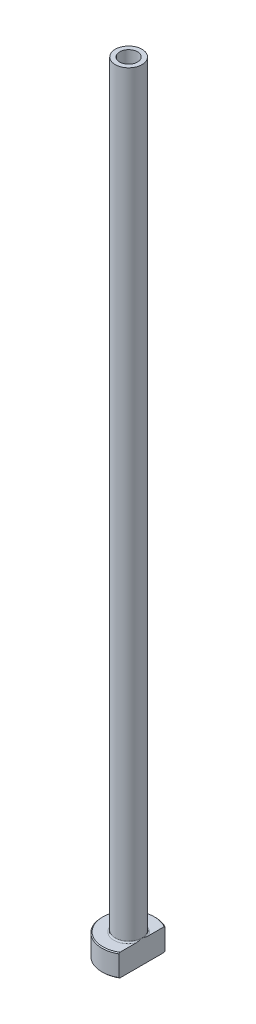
ISO-10303-21;
HEADER;
FILE_DESCRIPTION(('STEP AP214'),'2;1');
FILE_NAME('part.step','',(''),(''),'','','');
FILE_SCHEMA(('AUTOMOTIVE_DESIGN { 1 0 10303 214 1 1 1 1 }'));
ENDSEC;
DATA;
#1=APPLICATION_CONTEXT('core data for automotive mechanical design processes');
#2=APPLICATION_PROTOCOL_DEFINITION('international standard','automotive_design',2000,#1);
#3=PRODUCT_CONTEXT('',#1,'mechanical');
#4=PRODUCT('Part','Part','',(#3));
#5=PRODUCT_RELATED_PRODUCT_CATEGORY('part','',(#4));
#6=PRODUCT_DEFINITION_FORMATION('','',#4);
#7=PRODUCT_DEFINITION_CONTEXT('part definition',#1,'design');
#8=PRODUCT_DEFINITION('design','',#6,#7);
#9=PRODUCT_DEFINITION_SHAPE('','',#8);
#10=(LENGTH_UNIT() NAMED_UNIT(*) SI_UNIT(.MILLI.,.METRE.));
#11=(NAMED_UNIT(*) PLANE_ANGLE_UNIT() SI_UNIT($,.RADIAN.));
#12=(NAMED_UNIT(*) SI_UNIT($,.STERADIAN.) SOLID_ANGLE_UNIT());
#13=UNCERTAINTY_MEASURE_WITH_UNIT(LENGTH_MEASURE(1.E-05),#10,'distance_accuracy_value','');
#14=(GEOMETRIC_REPRESENTATION_CONTEXT(3) GLOBAL_UNCERTAINTY_ASSIGNED_CONTEXT((#13)) GLOBAL_UNIT_ASSIGNED_CONTEXT((#10,
#11,#12)) REPRESENTATION_CONTEXT('',''));
#15=CARTESIAN_POINT('',(0.,0.,0.));
#16=DIRECTION('',(0.,0.,1.));
#17=DIRECTION('',(1.,0.,0.));
#18=AXIS2_PLACEMENT_3D('',#15,#16,#17);
#19=CARTESIAN_POINT('',(0.,92.1876809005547,0.));
#20=DIRECTION('',(0.,1.,0.));
#21=DIRECTION('',(0.,0.,1.));
#22=AXIS2_PLACEMENT_3D('',#19,#20,#21);
#23=CYLINDRICAL_SURFACE('',#22,2.);
#24=CARTESIAN_POINT('',(0.,175.,0.));
#25=DIRECTION('',(0.,1.,0.));
#26=DIRECTION('',(0.,0.,1.));
#27=AXIS2_PLACEMENT_3D('',#24,#25,#26);
#28=CIRCLE('',#27,2.);
#29=CARTESIAN_POINT('',(0.,175.,2.));
#30=VERTEX_POINT('',#29);
#31=EDGE_CURVE('E167',#30,#30,#28,.T.);
#32=ORIENTED_EDGE('',*,*,#31,.T.);
#33=EDGE_LOOP('',(#32));
#34=FACE_BOUND('',#33,.T.);
#35=CARTESIAN_POINT('',(0.,130.,0.));
#36=DIRECTION('',(0.,1.,0.));
#37=DIRECTION('',(0.,0.,1.));
#38=AXIS2_PLACEMENT_3D('',#35,#36,#37);
#39=CIRCLE('',#38,2.);
#40=CARTESIAN_POINT('',(0.,130.,2.));
#41=VERTEX_POINT('',#40);
#42=EDGE_CURVE('E170',#41,#41,#39,.T.);
#43=ORIENTED_EDGE('',*,*,#42,.F.);
#44=EDGE_LOOP('',(#43));
#45=FACE_BOUND('',#44,.T.);
#46=ADVANCED_FACE('F32',(#34,#45),#23,.F.);
#47=CARTESIAN_POINT('',(-2.,175.,0.));
#48=DIRECTION('',(0.,1.,0.));
#49=DIRECTION('',(0.,0.,1.));
#50=AXIS2_PLACEMENT_3D('',#47,#48,#49);
#51=PLANE('',#50);
#52=CARTESIAN_POINT('',(0.,175.,0.));
#53=DIRECTION('',(0.,1.,0.));
#54=DIRECTION('',(0.,0.,1.));
#55=AXIS2_PLACEMENT_3D('',#52,#53,#54);
#56=CIRCLE('',#55,3.00000000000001);
#57=CARTESIAN_POINT('',(0.,175.,3.00000000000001));
#58=VERTEX_POINT('',#57);
#59=EDGE_CURVE('E174',#58,#58,#56,.T.);
#60=ORIENTED_EDGE('',*,*,#59,.T.);
#61=EDGE_LOOP('',(#60));
#62=FACE_BOUND('',#61,.T.);
#63=ORIENTED_EDGE('',*,*,#31,.F.);
#64=EDGE_LOOP('',(#63));
#65=FACE_BOUND('',#64,.T.);
#66=ADVANCED_FACE('F157',(#62,#65),#51,.T.);
#67=CARTESIAN_POINT('',(0.,92.1876809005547,0.));
#68=DIRECTION('',(0.,1.,0.));
#69=DIRECTION('',(0.,0.,1.));
#70=AXIS2_PLACEMENT_3D('',#67,#68,#69);
#71=CYLINDRICAL_SURFACE('',#70,3.);
#72=CARTESIAN_POINT('',(0.,5.3,0.));
#73=DIRECTION('',(0.,1.,0.));
#74=DIRECTION('',(0.,0.,1.));
#75=AXIS2_PLACEMENT_3D('',#72,#73,#74);
#76=CIRCLE('',#75,3.);
#77=CARTESIAN_POINT('',(3.,5.3,0.));
#78=VERTEX_POINT('',#77);
#79=EDGE_CURVE('E180',#78,#78,#76,.T.);
#80=ORIENTED_EDGE('',*,*,#79,.T.);
#81=EDGE_LOOP('',(#80));
#82=FACE_BOUND('',#81,.T.);
#83=ORIENTED_EDGE('',*,*,#59,.F.);
#84=EDGE_LOOP('',(#83));
#85=FACE_BOUND('',#84,.T.);
#86=ADVANCED_FACE('F162',(#82,#85),#71,.T.);
#87=CARTESIAN_POINT('',(-2.99999999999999,5.,0.));
#88=DIRECTION('',(0.,1.,0.));
#89=DIRECTION('',(0.,0.,1.));
#90=AXIS2_PLACEMENT_3D('',#87,#88,#89);
#91=PLANE('',#90);
#92=DIRECTION('',(0.,0.,1.));
#93=VECTOR('',#92,1.);
#94=CARTESIAN_POINT('',(2.99999999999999,5.,0.));
#95=LINE('',#94,#93);
#96=CARTESIAN_POINT('',(3.,5.,-4.96386945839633));
#97=VERTEX_POINT('',#96);
#98=CARTESIAN_POINT('',(2.99999999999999,5.,-1.37477270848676));
#99=VERTEX_POINT('',#98);
#100=EDGE_CURVE('E54',#97,#99,#95,.T.);
#101=ORIENTED_EDGE('',*,*,#100,.F.);
#102=CARTESIAN_POINT('',(0.,5.,0.));
#103=DIRECTION('',(0.,1.,0.));
#104=DIRECTION('',(0.,0.,1.));
#105=AXIS2_PLACEMENT_3D('',#102,#103,#104);
#106=CIRCLE('',#105,5.79999999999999);
#107=CARTESIAN_POINT('',(2.99999999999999,5.,4.96386945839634));
#108=VERTEX_POINT('',#107);
#109=EDGE_CURVE('E186',#97,#108,#106,.T.);
#110=ORIENTED_EDGE('',*,*,#109,.T.);
#111=CARTESIAN_POINT('',(2.99999999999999,5.,1.37477270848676));
#112=VERTEX_POINT('',#111);
#113=EDGE_CURVE('E134',#112,#108,#95,.T.);
#114=ORIENTED_EDGE('',*,*,#113,.F.);
#115=CARTESIAN_POINT('',(0.,5.,0.));
#116=DIRECTION('',(0.,1.,0.));
#117=DIRECTION('',(0.,0.,1.));
#118=AXIS2_PLACEMENT_3D('',#115,#116,#117);
#119=CIRCLE('',#118,3.3);
#120=EDGE_CURVE('E183',#112,#99,#119,.F.);
#121=ORIENTED_EDGE('',*,*,#120,.T.);
#122=EDGE_LOOP('',(#101,#110,#114,#121));
#123=FACE_BOUND('',#122,.T.);
#124=ADVANCED_FACE('F197',(#123),#91,.T.);
#125=CARTESIAN_POINT('',(0.,92.1876809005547,0.));
#126=DIRECTION('',(0.,1.,0.));
#127=DIRECTION('',(0.,0.,1.));
#128=AXIS2_PLACEMENT_3D('',#125,#126,#127);
#129=CYLINDRICAL_SURFACE('',#128,5.99999999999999);
#130=DIRECTION('',(0.,-1.,0.));
#131=VECTOR('',#130,1.);
#132=CARTESIAN_POINT('',(2.99999999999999,175.,5.19615242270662));
#133=LINE('',#132,#131);
#134=CARTESIAN_POINT('',(2.99999999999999,4.8,5.19615242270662));
#135=VERTEX_POINT('',#134);
#136=CARTESIAN_POINT('',(2.99999999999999,0.200000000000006,5.19615242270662));
#137=VERTEX_POINT('',#136);
#138=EDGE_CURVE('E82',#135,#137,#133,.T.);
#139=ORIENTED_EDGE('',*,*,#138,.F.);
#140=CARTESIAN_POINT('',(0.,4.8,0.));
#141=DIRECTION('',(0.,1.,0.));
#142=DIRECTION('',(0.,0.,1.));
#143=AXIS2_PLACEMENT_3D('',#140,#141,#142);
#144=CIRCLE('',#143,5.99999999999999);
#145=CARTESIAN_POINT('',(3.,4.8,-5.19615242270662));
#146=VERTEX_POINT('',#145);
#147=EDGE_CURVE('E95',#135,#146,#144,.F.);
#148=ORIENTED_EDGE('',*,*,#147,.T.);
#149=DIRECTION('',(0.,-1.,0.));
#150=VECTOR('',#149,1.);
#151=CARTESIAN_POINT('',(3.,175.,-5.19615242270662));
#152=LINE('',#151,#150);
#153=CARTESIAN_POINT('',(3.,0.200000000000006,-5.19615242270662));
#154=VERTEX_POINT('',#153);
#155=EDGE_CURVE('E192',#146,#154,#152,.T.);
#156=ORIENTED_EDGE('',*,*,#155,.T.);
#157=CARTESIAN_POINT('',(0.,0.200000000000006,0.));
#158=DIRECTION('',(0.,-1.,0.));
#159=DIRECTION('',(0.,0.,-1.));
#160=AXIS2_PLACEMENT_3D('',#157,#158,#159);
#161=CIRCLE('',#160,5.99999999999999);
#162=EDGE_CURVE('E98',#154,#137,#161,.F.);
#163=ORIENTED_EDGE('',*,*,#162,.T.);
#164=EDGE_LOOP('',(#139,#148,#156,#163));
#165=FACE_BOUND('',#164,.T.);
#166=ADVANCED_FACE('F190',(#165),#129,.T.);
#167=CARTESIAN_POINT('',(-5.99999999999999,0.,0.));
#168=DIRECTION('',(0.,-1.,0.));
#169=DIRECTION('',(0.,0.,-1.));
#170=AXIS2_PLACEMENT_3D('',#167,#168,#169);
#171=PLANE('',#170);
#172=CARTESIAN_POINT('',(0.,0.,0.));
#173=DIRECTION('',(0.,-1.,0.));
#174=DIRECTION('',(0.,0.,-1.));
#175=AXIS2_PLACEMENT_3D('',#172,#173,#174);
#176=CIRCLE('',#175,2.74999999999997);
#177=CARTESIAN_POINT('',(0.,0.,-2.74999999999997));
#178=VERTEX_POINT('',#177);
#179=EDGE_CURVE('E40',#178,#178,#176,.F.);
#180=ORIENTED_EDGE('',*,*,#179,.T.);
#181=EDGE_LOOP('',(#180));
#182=FACE_BOUND('',#181,.T.);
#183=DIRECTION('',(0.,0.,-1.));
#184=VECTOR('',#183,1.);
#185=CARTESIAN_POINT('',(2.99999999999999,0.,5.19615242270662));
#186=LINE('',#185,#184);
#187=CARTESIAN_POINT('',(2.99999999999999,0.,4.96386945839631));
#188=VERTEX_POINT('',#187);
#189=CARTESIAN_POINT('',(3.,0.,-4.96386945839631));
#190=VERTEX_POINT('',#189);
#191=EDGE_CURVE('E47',#188,#190,#186,.T.);
#192=ORIENTED_EDGE('',*,*,#191,.F.);
#193=CARTESIAN_POINT('',(0.,0.,0.));
#194=DIRECTION('',(0.,-1.,0.));
#195=DIRECTION('',(0.,0.,-1.));
#196=AXIS2_PLACEMENT_3D('',#193,#194,#195);
#197=CIRCLE('',#196,5.79999999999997);
#198=EDGE_CURVE('E92',#188,#190,#197,.T.);
#199=ORIENTED_EDGE('',*,*,#198,.T.);
#200=EDGE_LOOP('',(#192,#199));
#201=FACE_BOUND('',#200,.T.);
#202=ADVANCED_FACE('F91',(#182,#201),#171,.T.);
#203=CARTESIAN_POINT('',(0.,92.1876809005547,0.));
#204=DIRECTION('',(0.,1.,0.));
#205=DIRECTION('',(0.,0.,1.));
#206=AXIS2_PLACEMENT_3D('',#203,#204,#205);
#207=CYLINDRICAL_SURFACE('',#206,2.25);
#208=CARTESIAN_POINT('',(0.,0.499999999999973,0.));
#209=DIRECTION('',(0.,-1.,0.));
#210=DIRECTION('',(0.,0.,-1.));
#211=AXIS2_PLACEMENT_3D('',#208,#209,#210);
#212=CIRCLE('',#211,2.25);
#213=CARTESIAN_POINT('',(0.,0.499999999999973,-2.25));
#214=VERTEX_POINT('',#213);
#215=EDGE_CURVE('E11',#214,#214,#212,.T.);
#216=ORIENTED_EDGE('',*,*,#215,.T.);
#217=EDGE_LOOP('',(#216));
#218=FACE_BOUND('',#217,.T.);
#219=CARTESIAN_POINT('',(0.,118.,0.));
#220=DIRECTION('',(0.,1.,0.));
#221=DIRECTION('',(0.,0.,1.));
#222=AXIS2_PLACEMENT_3D('',#219,#220,#221);
#223=CIRCLE('',#222,2.25);
#224=CARTESIAN_POINT('',(0.,118.,2.25));
#225=VERTEX_POINT('',#224);
#226=EDGE_CURVE('E172',#225,#225,#223,.T.);
#227=ORIENTED_EDGE('',*,*,#226,.T.);
#228=EDGE_LOOP('',(#227));
#229=FACE_BOUND('',#228,.T.);
#230=ADVANCED_FACE('F215',(#218,#229),#207,.F.);
#231=CARTESIAN_POINT('',(0.,118.,0.));
#232=DIRECTION('',(0.,-1.,0.));
#233=DIRECTION('',(0.,0.,-1.));
#234=AXIS2_PLACEMENT_3D('',#231,#232,#233);
#235=CONICAL_SURFACE('',#234,2.25,0.0208303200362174);
#236=ORIENTED_EDGE('',*,*,#42,.T.);
#237=EDGE_LOOP('',(#236));
#238=FACE_BOUND('',#237,.T.);
#239=ORIENTED_EDGE('',*,*,#226,.F.);
#240=EDGE_LOOP('',(#239));
#241=FACE_BOUND('',#240,.T.);
#242=ADVANCED_FACE('F111',(#238,#241),#235,.F.);
#243=CARTESIAN_POINT('',(0.,5.3,0.));
#244=DIRECTION('',(0.,1.,0.));
#245=DIRECTION('',(0.,0.,1.));
#246=AXIS2_PLACEMENT_3D('',#243,#244,#245);
#247=TOROIDAL_SURFACE('',#246,3.3,0.3);
#248=ORIENTED_EDGE('',*,*,#120,.F.);
#249=CARTESIAN_POINT('',(3.,5.3,0.));
#250=CARTESIAN_POINT('',(3.,5.30000062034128,-1.12611958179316E-10));
#251=CARTESIAN_POINT('',(3.,5.30000124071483,1.79706824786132E-07));
#252=CARTESIAN_POINT('',(3.,5.30000241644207,7.12597591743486E-07));
#253=CARTESIAN_POINT('',(3.,5.3000029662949,1.07470913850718E-06));
#254=CARTESIAN_POINT('',(3.,5.30000408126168,1.93940830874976E-06));
#255=CARTESIAN_POINT('',(3.,5.30000463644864,2.45488622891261E-06));
#256=CARTESIAN_POINT('',(3.,5.30000565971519,3.54465557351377E-06));
#257=CARTESIAN_POINT('',(3.,5.30000612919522,4.11770702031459E-06));
#258=CARTESIAN_POINT('',(3.,5.30000778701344,6.25396492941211E-06));
#259=CARTESIAN_POINT('',(3.,5.30000888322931,7.8907090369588E-06));
#260=CARTESIAN_POINT('',(3.,5.30001076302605,1.11998059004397E-05));
#261=CARTESIAN_POINT('',(3.,5.30001156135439,1.28642117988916E-05));
#262=CARTESIAN_POINT('',(3.,5.30001474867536,1.96537181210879E-05));
#263=CARTESIAN_POINT('',(3.,5.30001702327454,2.4838025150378E-05));
#264=CARTESIAN_POINT('',(3.,5.30002052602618,3.48178497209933E-05));
#265=CARTESIAN_POINT('',(3.,5.30002184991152,3.95800639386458E-05));
#266=CARTESIAN_POINT('',(2.99999999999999,5.3000312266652,7.41814399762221E-05));
#267=CARTESIAN_POINT('',(2.99999999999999,5.30003808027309,0.000104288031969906));
#268=CARTESIAN_POINT('',(3.,5.30006804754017,0.000222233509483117));
#269=CARTESIAN_POINT('',(3.,5.30009687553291,0.000308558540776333));
#270=CARTESIAN_POINT('',(2.99999999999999,5.30020809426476,0.000648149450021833));
#271=CARTESIAN_POINT('',(2.99999999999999,5.30028657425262,0.000902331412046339));
#272=CARTESIAN_POINT('',(3.,5.30059876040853,0.00190491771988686));
#273=CARTESIAN_POINT('',(3.,5.30083723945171,0.00265218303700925));
#274=CARTESIAN_POINT('',(2.99999999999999,5.30182192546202,0.00574694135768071));
#275=CARTESIAN_POINT('',(2.99999999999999,5.30256224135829,0.00809584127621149));
#276=CARTESIAN_POINT('',(3.,5.31160267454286,0.0367678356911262));
#277=CARTESIAN_POINT('',(3.,5.31993817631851,0.0630827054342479));
#278=CARTESIAN_POINT('',(2.99999999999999,5.33621504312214,0.114704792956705));
#279=CARTESIAN_POINT('',(2.99999999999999,5.34415908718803,0.140011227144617));
#280=CARTESIAN_POINT('',(3.,5.36094382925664,0.193774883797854));
#281=CARTESIAN_POINT('',(3.,5.36977415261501,0.222235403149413));
#282=CARTESIAN_POINT('',(3.,5.38736474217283,0.279512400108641));
#283=CARTESIAN_POINT('',(3.,5.39612323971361,0.308329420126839));
#284=CARTESIAN_POINT('',(3.,5.41726575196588,0.378880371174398));
#285=CARTESIAN_POINT('',(3.,5.42952723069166,0.420651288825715));
#286=CARTESIAN_POINT('',(3.,5.45309597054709,0.503357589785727));
#287=CARTESIAN_POINT('',(3.,5.46441924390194,0.544288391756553));
#288=CARTESIAN_POINT('',(3.,5.48778169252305,0.632156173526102));
#289=CARTESIAN_POINT('',(3.,5.49969678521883,0.679126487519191));
#290=CARTESIAN_POINT('',(3.,5.52221484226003,0.773740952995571));
#291=CARTESIAN_POINT('',(3.,5.53280772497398,0.821387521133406));
#292=CARTESIAN_POINT('',(3.,5.55291503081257,0.920589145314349));
#293=CARTESIAN_POINT('',(3.,5.56229188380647,0.972172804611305));
#294=CARTESIAN_POINT('',(3.,5.57838694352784,1.07574836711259));
#295=CARTESIAN_POINT('',(3.,5.58510535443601,1.12774023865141));
#296=CARTESIAN_POINT('',(3.,5.59681427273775,1.2492441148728));
#297=CARTESIAN_POINT('',(3.,5.60051317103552,1.3189036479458));
#298=CARTESIAN_POINT('',(3.,5.59966579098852,1.42270835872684));
#299=CARTESIAN_POINT('',(3.,5.59835823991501,1.45688093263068));
#300=CARTESIAN_POINT('',(3.,5.59322745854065,1.52502533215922));
#301=CARTESIAN_POINT('',(3.,5.58940645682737,1.55899730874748));
#302=CARTESIAN_POINT('',(3.,5.57976146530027,1.61947815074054));
#303=CARTESIAN_POINT('',(3.,5.57451506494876,1.64607760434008));
#304=CARTESIAN_POINT('',(3.,5.56161153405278,1.69883648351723));
#305=CARTESIAN_POINT('',(3.,5.55394338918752,1.72499331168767));
#306=CARTESIAN_POINT('',(3.,5.53555176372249,1.77650913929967));
#307=CARTESIAN_POINT('',(3.,5.52480031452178,1.80185836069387));
#308=CARTESIAN_POINT('',(3.,5.49948027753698,1.8505454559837));
#309=CARTESIAN_POINT('',(3.,5.48493141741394,1.87389291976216));
#310=CARTESIAN_POINT('',(3.,5.45992470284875,1.90552135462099));
#311=CARTESIAN_POINT('',(3.,5.45133318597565,1.9152736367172));
#312=CARTESIAN_POINT('',(3.,5.43294163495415,1.93360072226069));
#313=CARTESIAN_POINT('',(3.,5.42314083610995,1.94217477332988));
#314=CARTESIAN_POINT('',(3.,5.40215892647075,1.95778354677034));
#315=CARTESIAN_POINT('',(3.,5.39096156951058,1.96479687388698));
#316=CARTESIAN_POINT('',(3.,5.36742144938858,1.97652218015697));
#317=CARTESIAN_POINT('',(3.,5.35508207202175,1.98124071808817));
#318=CARTESIAN_POINT('',(3.,5.33320117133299,1.98690185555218));
#319=CARTESIAN_POINT('',(3.,5.32383559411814,1.98852953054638));
#320=CARTESIAN_POINT('',(3.,5.30496375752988,1.99016898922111));
#321=CARTESIAN_POINT('',(3.,5.29545756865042,1.9901815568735));
#322=CARTESIAN_POINT('',(3.,5.27659318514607,1.98858978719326));
#323=CARTESIAN_POINT('',(3.,5.26723486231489,1.9869869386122));
#324=CARTESIAN_POINT('',(3.,5.24889957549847,1.98229727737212));
#325=CARTESIAN_POINT('',(3.,5.23992286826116,1.97920948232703));
#326=CARTESIAN_POINT('',(3.,5.21981293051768,1.97059641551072));
#327=CARTESIAN_POINT('',(3.,5.20887713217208,1.9646117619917));
#328=CARTESIAN_POINT('',(3.,5.18811536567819,1.95095727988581));
#329=CARTESIAN_POINT('',(3.,5.17829177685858,1.94328393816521));
#330=CARTESIAN_POINT('',(3.,5.15512177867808,1.92254223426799));
#331=CARTESIAN_POINT('',(3.,5.14247568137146,1.90869680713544));
#332=CARTESIAN_POINT('',(3.,5.11944595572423,1.87927587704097));
#333=CARTESIAN_POINT('',(3.,5.10906527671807,1.86369815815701));
#334=CARTESIAN_POINT('',(3.,5.08309609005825,1.81927355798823));
#335=CARTESIAN_POINT('',(3.,5.0694854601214,1.78928084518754));
#336=CARTESIAN_POINT('',(3.,5.04658664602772,1.72751962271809));
#337=CARTESIAN_POINT('',(3.,5.03733582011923,1.69573828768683));
#338=CARTESIAN_POINT('',(3.,5.02214318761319,1.63079918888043));
#339=CARTESIAN_POINT('',(3.,5.01626537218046,1.5976268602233));
#340=CARTESIAN_POINT('',(3.,5.00734002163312,1.53086029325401));
#341=CARTESIAN_POINT('',(3.,5.0042979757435,1.49726536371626));
#342=CARTESIAN_POINT('',(3.,5.00059037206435,1.4310087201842));
#343=CARTESIAN_POINT('',(3.,4.99985343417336,1.39835069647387));
#344=CARTESIAN_POINT('',(3.,5.000193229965,1.33318312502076));
#345=CARTESIAN_POINT('',(3.,5.00126261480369,1.30067351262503));
#346=CARTESIAN_POINT('',(3.,5.00569854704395,1.22190465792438));
#347=CARTESIAN_POINT('',(3.,5.00984986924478,1.17569031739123));
#348=CARTESIAN_POINT('',(3.,5.0206087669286,1.08357061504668));
#349=CARTESIAN_POINT('',(3.,5.02721586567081,1.03766519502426));
#350=CARTESIAN_POINT('',(3.,5.04258096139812,0.94513016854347));
#351=CARTESIAN_POINT('',(3.,5.0513851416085,0.898508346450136));
#352=CARTESIAN_POINT('',(3.,5.07066869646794,0.805496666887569));
#353=CARTESIAN_POINT('',(3.,5.081152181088,0.759107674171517));
#354=CARTESIAN_POINT('',(3.,5.10738921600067,0.650207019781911));
#355=CARTESIAN_POINT('',(3.,5.12369110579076,0.587828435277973));
#356=CARTESIAN_POINT('',(3.,5.15777680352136,0.464212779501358));
#357=CARTESIAN_POINT('',(2.99999999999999,5.17554263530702,0.40297066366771));
#358=CARTESIAN_POINT('',(3.,5.21006724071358,0.287596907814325));
#359=CARTESIAN_POINT('',(3.,5.22671796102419,0.233432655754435));
#360=CARTESIAN_POINT('',(2.99999999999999,5.25241226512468,0.150940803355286));
#361=CARTESIAN_POINT('',(2.99999999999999,5.26131063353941,0.122567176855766));
#362=CARTESIAN_POINT('',(3.,5.27905176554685,0.0662804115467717));
#363=CARTESIAN_POINT('',(3.,5.28789327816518,0.0383669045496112));
#364=CARTESIAN_POINT('',(2.99999999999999,5.29743877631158,0.0080925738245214));
#365=CARTESIAN_POINT('',(2.99999999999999,5.29818012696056,0.005740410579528));
#366=CARTESIAN_POINT('',(3.,5.29916506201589,0.00264489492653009));
#367=CARTESIAN_POINT('',(3.,5.29940274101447,0.00190013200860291));
#368=CARTESIAN_POINT('',(2.99999999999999,5.2997139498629,0.000900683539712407));
#369=CARTESIAN_POINT('',(2.99999999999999,5.29979223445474,0.000647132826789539));
#370=CARTESIAN_POINT('',(3.,5.29990321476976,0.000308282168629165));
#371=CARTESIAN_POINT('',(3.,5.29993200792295,0.000222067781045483));
#372=CARTESIAN_POINT('',(2.99999999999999,5.29996194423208,0.000104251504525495));
#373=CARTESIAN_POINT('',(2.99999999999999,5.29996879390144,7.41614237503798E-05));
#374=CARTESIAN_POINT('',(3.,5.29997816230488,3.95766702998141E-05));
#375=CARTESIAN_POINT('',(3.,5.29997948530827,3.48154662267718E-05));
#376=CARTESIAN_POINT('',(3.,5.29998298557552,2.48376276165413E-05));
#377=CARTESIAN_POINT('',(3.,5.29998525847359,1.96542450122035E-05));
#378=CARTESIAN_POINT('',(3.,5.29998844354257,1.28656652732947E-05));
#379=CARTESIAN_POINT('',(3.,5.29998924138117,1.12013347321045E-05));
#380=CARTESIAN_POINT('',(3.,5.29999112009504,7.89230008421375E-06));
#381=CARTESIAN_POINT('',(3.,5.29999221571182,6.25553517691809E-06));
#382=CARTESIAN_POINT('',(3.,5.2999938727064,4.11914356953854E-06));
#383=CARTESIAN_POINT('',(3.,5.29999434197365,3.54603083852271E-06));
#384=CARTESIAN_POINT('',(3.,5.29999536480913,2.45610059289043E-06));
#385=CARTESIAN_POINT('',(3.,5.29999591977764,1.94052220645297E-06));
#386=CARTESIAN_POINT('',(3.,5.2999970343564,1.07558317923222E-06));
#387=CARTESIAN_POINT('',(3.,5.29999758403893,7.13339401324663E-07));
#388=CARTESIAN_POINT('',(3.,5.29999875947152,1.80121922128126E-07));
#389=CARTESIAN_POINT('',(3.,5.29999937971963,1.12601402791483E-10));
#390=CARTESIAN_POINT('',(3.,5.3,0.));
#391=B_SPLINE_CURVE_WITH_KNOTS('',3,(#249,#250,#251,#252,#253,#254,#255,#256,#257,#258,#259,
#260,#261,#262,#263,#264,#265,#266,#267,#268,#269,#270,#271,#272,#273,#274,#275,#276,#277,#278,
#279,#280,#281,#282,#283,#284,#285,#286,#287,#288,#289,#290,#291,#292,#293,#294,#295,#296,#297,
#298,#299,#300,#301,#302,#303,#304,#305,#306,#307,#308,#309,#310,#311,#312,#313,#314,#315,#316,
#317,#318,#319,#320,#321,#322,#323,#324,#325,#326,#327,#328,#329,#330,#331,#332,#333,#334,#335,
#336,#337,#338,#339,#340,#341,#342,#343,#344,#345,#346,#347,#348,#349,#350,#351,#352,#353,#354,
#355,#356,#357,#358,#359,#360,#361,#362,#363,#364,#365,#366,#367,#368,#369,#370,#371,#372,#373,
#374,#375,#376,#377,#378,#379,#380,#381,#382,#383,#384,#385,#386,#387,#388,#389,#390),
.UNSPECIFIED.,.T.,.F.,(4,2,2,2,2,2,2,2,2,2,2,2,2,2,2,2,2,2,2,2,2,2,2,2,2,2,2,2,2,2,2,2,2,2,2,2,
2,2,2,2,2,2,2,2,2,2,2,2,2,2,2,2,2,2,2,2,2,2,2,2,2,2,2,2,2,2,2,2,2,2,4),(0.,1.86513864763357E-06,
3.83353246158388E-06,6.09513235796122E-06,8.31560539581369E-06,1.42000698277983E-05,
1.97335497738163E-05,3.66769861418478E-05,5.14858312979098E-05,0.000144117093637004,
0.000416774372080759,0.00121521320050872,0.00356794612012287,0.0109568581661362,
0.0937636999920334,0.173336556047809,0.262732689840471,0.353088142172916,0.483684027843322,
0.611082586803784,0.75643954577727,0.902844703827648,1.06007042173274,1.21728406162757,
1.42611662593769,1.52864191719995,1.63107642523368,1.71232857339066,1.79395571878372,
1.87634808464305,1.95832065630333,1.99722769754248,2.03615946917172,2.0755959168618,
2.11491897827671,2.14330913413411,2.1716855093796,2.20003575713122,2.22840478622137,
2.26559554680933,2.30286442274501,2.35880214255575,2.41481225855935,2.51307007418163,
2.61215518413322,2.71306273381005,2.81416520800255,2.91210427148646,3.00964583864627,
3.14875779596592,3.28784276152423,3.43014232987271,3.5727956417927,3.76617940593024,
3.95746724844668,4.12746077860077,4.21667041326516,4.30450746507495,4.31190664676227,
4.31425150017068,4.31504795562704,4.31532026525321,4.31541284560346,4.31542765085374,
4.31544458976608,4.31545012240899,4.31545600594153,4.315458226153,4.31546048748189,
4.31546245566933,4.31546432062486),.UNSPECIFIED.);
#392=EDGE_CURVE('E126',#112,#78,#391,.T.);
#393=ORIENTED_EDGE('',*,*,#392,.T.);
#394=ORIENTED_EDGE('',*,*,#79,.F.);
#395=CARTESIAN_POINT('',(3.,5.3,0.));
#396=CARTESIAN_POINT('',(3.,5.29999937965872,1.1261246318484E-10));
#397=CARTESIAN_POINT('',(3.,5.29999875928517,-1.79706824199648E-07));
#398=CARTESIAN_POINT('',(3.,5.29999758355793,-7.12597591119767E-07));
#399=CARTESIAN_POINT('',(3.,5.2999970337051,-1.07470913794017E-06));
#400=CARTESIAN_POINT('',(3.,5.29999591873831,-1.93940830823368E-06));
#401=CARTESIAN_POINT('',(3.,5.29999536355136,-2.45488622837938E-06));
#402=CARTESIAN_POINT('',(3.,5.29999434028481,-3.54465557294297E-06));
#403=CARTESIAN_POINT('',(3.,5.29999387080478,-4.11770701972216E-06));
#404=CARTESIAN_POINT('',(3.,5.29999221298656,-6.25396492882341E-06));
#405=CARTESIAN_POINT('',(3.,5.29999111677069,-7.89070903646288E-06));
#406=CARTESIAN_POINT('',(3.,5.29998923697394,-1.11998058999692E-05));
#407=CARTESIAN_POINT('',(3.,5.2999884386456,-1.28642117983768E-05));
#408=CARTESIAN_POINT('',(3.,5.29998525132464,-1.96537181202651E-05));
#409=CARTESIAN_POINT('',(3.,5.29998297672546,-2.48380251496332E-05));
#410=CARTESIAN_POINT('',(3.,5.29997947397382,-3.48178497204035E-05));
#411=CARTESIAN_POINT('',(3.,5.29997815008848,-3.9580063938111E-05));
#412=CARTESIAN_POINT('',(2.99999999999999,5.2999687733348,-7.41814399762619E-05));
#413=CARTESIAN_POINT('',(2.99999999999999,5.2999619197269,-0.00010428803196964));
#414=CARTESIAN_POINT('',(3.,5.29993195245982,-0.00022223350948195));
#415=CARTESIAN_POINT('',(3.,5.29990312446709,-0.000308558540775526));
#416=CARTESIAN_POINT('',(2.99999999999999,5.29979190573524,-0.000648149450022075));
#417=CARTESIAN_POINT('',(2.99999999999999,5.29971342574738,-0.000902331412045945));
#418=CARTESIAN_POINT('',(3.,5.29940123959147,-0.00190491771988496));
#419=CARTESIAN_POINT('',(3.,5.29916276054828,-0.00265218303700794));
#420=CARTESIAN_POINT('',(2.99999999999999,5.29817807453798,-0.00574694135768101));
#421=CARTESIAN_POINT('',(2.99999999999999,5.29743775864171,-0.00809584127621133));
#422=CARTESIAN_POINT('',(3.,5.28839732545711,-0.0367678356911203));
#423=CARTESIAN_POINT('',(3.,5.28006182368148,-0.0630827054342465));
#424=CARTESIAN_POINT('',(2.99999999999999,5.26378495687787,-0.114704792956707));
#425=CARTESIAN_POINT('',(2.99999999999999,5.25584091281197,-0.140011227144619));
#426=CARTESIAN_POINT('',(3.,5.23905617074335,-0.193774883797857));
#427=CARTESIAN_POINT('',(3.,5.23022584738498,-0.222235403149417));
#428=CARTESIAN_POINT('',(3.,5.21263525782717,-0.279512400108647));
#429=CARTESIAN_POINT('',(3.,5.20387676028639,-0.308329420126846));
#430=CARTESIAN_POINT('',(3.,5.18273424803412,-0.378880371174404));
#431=CARTESIAN_POINT('',(3.,5.17047276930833,-0.42065128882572));
#432=CARTESIAN_POINT('',(3.,5.14690402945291,-0.503357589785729));
#433=CARTESIAN_POINT('',(3.,5.13558075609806,-0.544288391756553));
#434=CARTESIAN_POINT('',(3.,5.11221830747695,-0.632156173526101));
#435=CARTESIAN_POINT('',(3.,5.10030321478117,-0.67912648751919));
#436=CARTESIAN_POINT('',(3.,5.07778515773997,-0.77374095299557));
#437=CARTESIAN_POINT('',(3.,5.06719227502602,-0.821387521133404));
#438=CARTESIAN_POINT('',(3.,5.04708496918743,-0.920589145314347));
#439=CARTESIAN_POINT('',(3.,5.03770811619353,-0.972172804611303));
#440=CARTESIAN_POINT('',(3.,5.02161305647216,-1.07574836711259));
#441=CARTESIAN_POINT('',(3.,5.01489464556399,-1.1277402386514));
#442=CARTESIAN_POINT('',(3.,5.00318572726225,-1.2492441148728));
#443=CARTESIAN_POINT('',(3.,4.99948682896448,-1.3189036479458));
#444=CARTESIAN_POINT('',(3.,5.00033420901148,-1.42270835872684));
#445=CARTESIAN_POINT('',(3.,5.00164176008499,-1.45688093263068));
#446=CARTESIAN_POINT('',(3.,5.00677254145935,-1.52502533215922));
#447=CARTESIAN_POINT('',(3.,5.01059354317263,-1.55899730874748));
#448=CARTESIAN_POINT('',(3.,5.02023853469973,-1.61947815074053));
#449=CARTESIAN_POINT('',(3.,5.02548493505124,-1.64607760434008));
#450=CARTESIAN_POINT('',(3.,5.03838846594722,-1.69883648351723));
#451=CARTESIAN_POINT('',(3.,5.04605661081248,-1.72499331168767));
#452=CARTESIAN_POINT('',(3.,5.06444823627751,-1.77650913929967));
#453=CARTESIAN_POINT('',(3.,5.07519968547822,-1.80185836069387));
#454=CARTESIAN_POINT('',(3.,5.10051972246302,-1.8505454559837));
#455=CARTESIAN_POINT('',(3.,5.11506858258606,-1.87389291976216));
#456=CARTESIAN_POINT('',(3.,5.14007529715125,-1.90552135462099));
#457=CARTESIAN_POINT('',(3.,5.14866681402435,-1.9152736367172));
#458=CARTESIAN_POINT('',(3.,5.16705836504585,-1.93360072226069));
#459=CARTESIAN_POINT('',(3.,5.17685916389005,-1.94217477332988));
#460=CARTESIAN_POINT('',(3.,5.19784107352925,-1.95778354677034));
#461=CARTESIAN_POINT('',(3.,5.20903843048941,-1.96479687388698));
#462=CARTESIAN_POINT('',(3.,5.23257855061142,-1.97652218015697));
#463=CARTESIAN_POINT('',(3.,5.24491792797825,-1.98124071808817));
#464=CARTESIAN_POINT('',(3.,5.26679882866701,-1.98690185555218));
#465=CARTESIAN_POINT('',(3.,5.27616440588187,-1.98852953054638));
#466=CARTESIAN_POINT('',(3.,5.29503624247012,-1.99016898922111));
#467=CARTESIAN_POINT('',(3.,5.30454243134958,-1.9901815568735));
#468=CARTESIAN_POINT('',(3.,5.32340681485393,-1.98858978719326));
#469=CARTESIAN_POINT('',(3.,5.33276513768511,-1.98698693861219));
#470=CARTESIAN_POINT('',(3.,5.35110042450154,-1.98229727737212));
#471=CARTESIAN_POINT('',(3.,5.36007713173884,-1.97920948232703));
#472=CARTESIAN_POINT('',(3.,5.38018706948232,-1.97059641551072));
#473=CARTESIAN_POINT('',(3.,5.39112286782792,-1.9646117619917));
#474=CARTESIAN_POINT('',(3.,5.41188463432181,-1.95095727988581));
#475=CARTESIAN_POINT('',(3.,5.42170822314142,-1.94328393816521));
#476=CARTESIAN_POINT('',(3.,5.44487822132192,-1.92254223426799));
#477=CARTESIAN_POINT('',(3.,5.45752431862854,-1.90869680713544));
#478=CARTESIAN_POINT('',(3.,5.48055404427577,-1.87927587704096));
#479=CARTESIAN_POINT('',(3.,5.49093472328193,-1.86369815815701));
#480=CARTESIAN_POINT('',(3.,5.51690390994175,-1.81927355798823));
#481=CARTESIAN_POINT('',(3.,5.5305145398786,-1.78928084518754));
#482=CARTESIAN_POINT('',(3.,5.55341335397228,-1.72751962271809));
#483=CARTESIAN_POINT('',(3.,5.56266417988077,-1.69573828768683));
#484=CARTESIAN_POINT('',(3.,5.57785681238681,-1.63079918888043));
#485=CARTESIAN_POINT('',(3.,5.58373462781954,-1.5976268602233));
#486=CARTESIAN_POINT('',(3.,5.59265997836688,-1.53086029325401));
#487=CARTESIAN_POINT('',(3.,5.5957020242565,-1.49726536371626));
#488=CARTESIAN_POINT('',(3.,5.59940962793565,-1.4310087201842));
#489=CARTESIAN_POINT('',(3.,5.60014656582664,-1.39835069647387));
#490=CARTESIAN_POINT('',(3.,5.59980677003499,-1.33318312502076));
#491=CARTESIAN_POINT('',(3.,5.59873738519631,-1.30067351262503));
#492=CARTESIAN_POINT('',(3.,5.59430145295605,-1.22190465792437));
#493=CARTESIAN_POINT('',(3.,5.59015013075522,-1.17569031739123));
#494=CARTESIAN_POINT('',(3.,5.5793912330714,-1.08357061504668));
#495=CARTESIAN_POINT('',(3.,5.57278413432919,-1.03766519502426));
#496=CARTESIAN_POINT('',(3.,5.55741903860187,-0.945130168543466));
#497=CARTESIAN_POINT('',(3.,5.5486148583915,-0.898508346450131));
#498=CARTESIAN_POINT('',(3.,5.52933130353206,-0.805496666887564));
#499=CARTESIAN_POINT('',(3.,5.518847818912,-0.759107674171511));
#500=CARTESIAN_POINT('',(3.,5.49261078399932,-0.650207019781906));
#501=CARTESIAN_POINT('',(3.,5.47630889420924,-0.587828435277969));
#502=CARTESIAN_POINT('',(3.,5.44222319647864,-0.464212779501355));
#503=CARTESIAN_POINT('',(2.99999999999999,5.42445736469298,-0.402970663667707));
#504=CARTESIAN_POINT('',(3.,5.38993275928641,-0.287596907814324));
#505=CARTESIAN_POINT('',(3.,5.3732820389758,-0.233432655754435));
#506=CARTESIAN_POINT('',(2.99999999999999,5.34758773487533,-0.150940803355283));
#507=CARTESIAN_POINT('',(2.99999999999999,5.3386893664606,-0.122567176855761));
#508=CARTESIAN_POINT('',(3.,5.32094823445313,-0.0662804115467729));
#509=CARTESIAN_POINT('',(3.,5.31210672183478,-0.0383669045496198));
#510=CARTESIAN_POINT('',(2.99999999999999,5.30256122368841,-0.00809257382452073));
#511=CARTESIAN_POINT('',(2.99999999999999,5.30181987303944,-0.00574041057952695));
#512=CARTESIAN_POINT('',(3.,5.3008349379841,-0.00264489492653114));
#513=CARTESIAN_POINT('',(3.,5.30059725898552,-0.00190013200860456));
#514=CARTESIAN_POINT('',(2.99999999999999,5.3002860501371,-0.000900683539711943));
#515=CARTESIAN_POINT('',(2.99999999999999,5.30020776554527,-0.000647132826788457));
#516=CARTESIAN_POINT('',(3.,5.30009678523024,-0.00030828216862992));
#517=CARTESIAN_POINT('',(3.,5.30006799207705,-0.000222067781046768));
#518=CARTESIAN_POINT('',(2.99999999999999,5.30003805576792,-0.00010425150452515));
#519=CARTESIAN_POINT('',(2.99999999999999,5.30003120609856,-7.41614237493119E-05));
#520=CARTESIAN_POINT('',(3.,5.30002183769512,-3.95766702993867E-05));
#521=CARTESIAN_POINT('',(3.,5.30002051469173,-3.48154662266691E-05));
#522=CARTESIAN_POINT('',(3.,5.30001701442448,-2.48376276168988E-05));
#523=CARTESIAN_POINT('',(3.,5.30001474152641,-1.96542450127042E-05));
#524=CARTESIAN_POINT('',(3.,5.30001155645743,-1.28656652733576E-05));
#525=CARTESIAN_POINT('',(3.,5.30001075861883,-1.12013347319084E-05));
#526=CARTESIAN_POINT('',(3.,5.30000887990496,-7.89230008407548E-06));
#527=CARTESIAN_POINT('',(3.,5.30000778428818,-6.25553517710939E-06));
#528=CARTESIAN_POINT('',(3.,5.3000061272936,-4.11914356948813E-06));
#529=CARTESIAN_POINT('',(3.,5.30000565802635,-3.54603083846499E-06));
#530=CARTESIAN_POINT('',(3.,5.30000463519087,-2.45610059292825E-06));
#531=CARTESIAN_POINT('',(3.,5.30000408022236,-1.94052220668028E-06));
#532=CARTESIAN_POINT('',(3.,5.3000029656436,-1.0755831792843E-06));
#533=CARTESIAN_POINT('',(3.,5.30000241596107,-7.13339401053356E-07));
#534=CARTESIAN_POINT('',(3.,5.30000124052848,-1.80121921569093E-07));
#535=CARTESIAN_POINT('',(3.,5.30000062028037,-1.1260090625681E-10));
#536=CARTESIAN_POINT('',(3.,5.3,0.));
#537=B_SPLINE_CURVE_WITH_KNOTS('',3,(#395,#396,#397,#398,#399,#400,#401,#402,#403,#404,#405,
#406,#407,#408,#409,#410,#411,#412,#413,#414,#415,#416,#417,#418,#419,#420,#421,#422,#423,#424,
#425,#426,#427,#428,#429,#430,#431,#432,#433,#434,#435,#436,#437,#438,#439,#440,#441,#442,#443,
#444,#445,#446,#447,#448,#449,#450,#451,#452,#453,#454,#455,#456,#457,#458,#459,#460,#461,#462,
#463,#464,#465,#466,#467,#468,#469,#470,#471,#472,#473,#474,#475,#476,#477,#478,#479,#480,#481,
#482,#483,#484,#485,#486,#487,#488,#489,#490,#491,#492,#493,#494,#495,#496,#497,#498,#499,#500,
#501,#502,#503,#504,#505,#506,#507,#508,#509,#510,#511,#512,#513,#514,#515,#516,#517,#518,#519,
#520,#521,#522,#523,#524,#525,#526,#527,#528,#529,#530,#531,#532,#533,#534,#535,#536),
.UNSPECIFIED.,.T.,.F.,(4,2,2,2,2,2,2,2,2,2,2,2,2,2,2,2,2,2,2,2,2,2,2,2,2,2,2,2,2,2,2,2,2,2,2,2,
2,2,2,2,2,2,2,2,2,2,2,2,2,2,2,2,2,2,2,2,2,2,2,2,2,2,2,2,2,2,2,2,2,2,4),(0.,1.86513864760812E-06,
3.83353246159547E-06,6.09513235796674E-06,8.31560539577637E-06,1.42000698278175E-05,
1.97335497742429E-05,3.66769861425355E-05,5.14858312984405E-05,0.000144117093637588,
0.000416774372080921,0.00121521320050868,0.00356794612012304,0.0109568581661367,
0.0937636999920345,0.173336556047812,0.262732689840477,0.353088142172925,0.483684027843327,
0.611082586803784,0.756439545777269,0.902844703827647,1.06007042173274,1.21728406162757,
1.42611662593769,1.52864191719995,1.63107642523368,1.71232857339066,1.79395571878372,
1.87634808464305,1.95832065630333,1.99722769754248,2.03615946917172,2.0755959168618,
2.11491897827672,2.14330913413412,2.1716855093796,2.20003575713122,2.22840478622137,
2.26559554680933,2.30286442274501,2.35880214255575,2.41481225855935,2.51307007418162,
2.61215518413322,2.71306273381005,2.81416520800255,2.91210427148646,3.00964583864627,
3.14875779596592,3.28784276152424,3.43014232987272,3.57279564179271,3.76617940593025,
3.95746724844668,4.12746077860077,4.21667041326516,4.30450746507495,4.31190664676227,
4.31425150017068,4.31504795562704,4.31532026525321,4.31541284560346,4.31542765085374,
4.31544458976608,4.31545012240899,4.31545600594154,4.315458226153,4.31546048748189,
4.31546245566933,4.31546432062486),.UNSPECIFIED.);
#538=EDGE_CURVE('E135',#78,#99,#537,.T.);
#539=ORIENTED_EDGE('',*,*,#538,.T.);
#540=EDGE_LOOP('',(#248,#393,#394,#539));
#541=FACE_BOUND('',#540,.T.);
#542=ADVANCED_FACE('F141',(#541),#247,.F.);
#543=CARTESIAN_POINT('',(0.,5.,0.));
#544=DIRECTION('',(0.,-1.,0.));
#545=DIRECTION('',(0.,0.,-1.));
#546=AXIS2_PLACEMENT_3D('',#543,#544,#545);
#547=CONICAL_SURFACE('',#546,5.79999999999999,0.785398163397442);
#548=CARTESIAN_POINT('',(3.,-1.01993959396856,-11.432889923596));
#549=CARTESIAN_POINT('',(3.,-0.769424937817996,-11.1738796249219));
#550=CARTESIAN_POINT('',(3.,-0.519179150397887,-10.9146084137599));
#551=CARTESIAN_POINT('',(3.,-0.019384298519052,-10.395389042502));
#552=CARTESIAN_POINT('',(3.,0.230164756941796,-10.1354408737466));
#553=CARTESIAN_POINT('',(3.,0.728528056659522,-9.61458602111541));
#554=CARTESIAN_POINT('',(3.,0.977341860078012,-9.35367891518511));
#555=CARTESIAN_POINT('',(3.,1.47386965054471,-8.83082274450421));
#556=CARTESIAN_POINT('',(3.,1.72158364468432,-8.56887368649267));
#557=CARTESIAN_POINT('',(3.,2.21069282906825,-8.04884148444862));
#558=CARTESIAN_POINT('',(3.,2.45211594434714,-7.7907846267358));
#559=CARTESIAN_POINT('',(3.,2.93315589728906,-7.27299342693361));
#560=CARTESIAN_POINT('',(3.,3.17277274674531,-7.01325909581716));
#561=CARTESIAN_POINT('',(3.,3.64950020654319,-6.49159990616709));
#562=CARTESIAN_POINT('',(3.,3.88661134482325,-6.22967553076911));
#563=CARTESIAN_POINT('',(3.,4.35738571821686,-5.70275148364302));
#564=CARTESIAN_POINT('',(3.,4.59104909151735,-5.43775193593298));
#565=CARTESIAN_POINT('',(3.,4.96416348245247,-5.00636825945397));
#566=CARTESIAN_POINT('',(3.,5.10520133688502,-4.84135845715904));
#567=CARTESIAN_POINT('',(3.,5.38476673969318,-4.50919282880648));
#568=CARTESIAN_POINT('',(3.,5.52329404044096,-4.342036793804));
#569=CARTESIAN_POINT('',(3.,5.79842961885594,-4.00319933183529));
#570=CARTESIAN_POINT('',(3.,5.93500216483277,-3.83148875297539));
#571=CARTESIAN_POINT('',(3.,6.20336281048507,-3.48442112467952));
#572=CARTESIAN_POINT('',(3.,6.33515205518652,-3.30906496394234));
#573=CARTESIAN_POINT('',(3.,6.59393382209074,-2.95070802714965));
#574=CARTESIAN_POINT('',(3.,6.72082315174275,-2.76763161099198));
#575=CARTESIAN_POINT('',(3.,6.90336321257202,-2.48771743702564));
#576=CARTESIAN_POINT('',(3.,6.96295431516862,-2.39345390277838));
#577=CARTESIAN_POINT('',(3.,7.07882720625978,-2.20292146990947));
#578=CARTESIAN_POINT('',(3.,7.13510937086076,-2.10665280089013));
#579=CARTESIAN_POINT('',(3.,7.24288059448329,-1.91297779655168));
#580=CARTESIAN_POINT('',(3.,7.29441986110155,-1.81559978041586));
#581=CARTESIAN_POINT('',(3.,7.39241237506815,-1.61833215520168));
#582=CARTESIAN_POINT('',(3.,7.43886469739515,-1.51844209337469));
#583=CARTESIAN_POINT('',(3.,7.56840030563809,-1.21511948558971));
#584=CARTESIAN_POINT('',(3.,7.64209011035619,-1.00730397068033));
#585=CARTESIAN_POINT('',(3.,7.72186700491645,-0.695731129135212));
#586=CARTESIAN_POINT('',(3.,7.7430290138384,-0.595791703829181));
#587=CARTESIAN_POINT('',(3.,7.77582528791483,-0.39432596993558));
#588=CARTESIAN_POINT('',(3.,7.78746040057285,-0.292799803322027));
#589=CARTESIAN_POINT('',(3.,7.80037895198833,-0.0893987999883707));
#590=CARTESIAN_POINT('',(3.,7.80169449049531,0.0124739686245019));
#591=CARTESIAN_POINT('',(3.,7.79396363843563,0.215826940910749));
#592=CARTESIAN_POINT('',(3.,7.78491639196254,0.317307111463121));
#593=CARTESIAN_POINT('',(3.,7.75721241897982,0.518039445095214));
#594=CARTESIAN_POINT('',(3.,7.73863812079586,0.617303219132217));
#595=CARTESIAN_POINT('',(3.,7.69303955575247,0.813850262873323));
#596=CARTESIAN_POINT('',(3.,7.66601427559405,0.911133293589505));
#597=CARTESIAN_POINT('',(3.,7.60464499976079,1.10394843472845));
#598=CARTESIAN_POINT('',(3.,7.57025976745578,1.19946724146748));
#599=CARTESIAN_POINT('',(3.,7.4955576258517,1.38810736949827));
#600=CARTESIAN_POINT('',(3.,7.45524192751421,1.48122917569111));
#601=CARTESIAN_POINT('',(3.,7.36961028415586,1.66561491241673));
#602=CARTESIAN_POINT('',(3.,7.32427350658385,1.75686908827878));
#603=CARTESIAN_POINT('',(3.,7.2296607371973,1.93732130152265));
#604=CARTESIAN_POINT('',(3.,7.18038388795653,2.02651888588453));
#605=CARTESIAN_POINT('',(3.,7.02771106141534,2.29153460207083));
#606=CARTESIAN_POINT('',(2.99999999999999,6.91955486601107,2.46460625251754));
#607=CARTESIAN_POINT('',(2.99999999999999,6.69440299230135,2.80577028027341));
#608=CARTESIAN_POINT('',(2.99999999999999,6.57737415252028,2.97384034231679));
#609=CARTESIAN_POINT('',(2.99999999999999,6.33748949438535,3.30561771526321));
#610=CARTESIAN_POINT('',(2.99999999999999,6.21463662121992,3.46932716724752));
#611=CARTESIAN_POINT('',(2.99999999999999,5.96308085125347,3.79561670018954));
#612=CARTESIAN_POINT('',(2.99999999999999,5.83432224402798,3.95815356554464));
#613=CARTESIAN_POINT('',(2.99999999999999,5.573613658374,4.28066737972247));
#614=CARTESIAN_POINT('',(2.99999999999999,5.44166333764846,4.44064405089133));
#615=CARTESIAN_POINT('',(2.99999999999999,5.17568445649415,4.7581955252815));
#616=CARTESIAN_POINT('',(2.99999999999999,5.04166171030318,4.91577521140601));
#617=CARTESIAN_POINT('',(2.99999999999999,4.77176230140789,5.22934053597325));
#618=CARTESIAN_POINT('',(2.99999999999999,4.63588560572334,5.38532614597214));
#619=CARTESIAN_POINT('',(2.99999999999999,4.27256222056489,5.79849838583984));
#620=CARTESIAN_POINT('',(2.99999999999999,4.04384014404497,6.054562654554));
#621=CARTESIAN_POINT('',(2.99999999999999,3.58360020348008,6.56417037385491));
#622=CARTESIAN_POINT('',(2.99999999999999,3.35208226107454,6.81771375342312));
#623=CARTESIAN_POINT('',(2.99999999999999,2.88678846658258,7.32315936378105));
#624=CARTESIAN_POINT('',(2.99999999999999,2.65301069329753,7.57505982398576));
#625=CARTESIAN_POINT('',(2.99999999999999,2.18392232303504,8.07742926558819));
#626=CARTESIAN_POINT('',(2.99999999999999,1.94861172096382,8.3278982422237));
#627=CARTESIAN_POINT('',(2.99999999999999,1.48651581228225,8.81743943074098));
#628=CARTESIAN_POINT('',(2.99999999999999,1.2597780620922,9.0565565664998));
#629=CARTESIAN_POINT('',(2.99999999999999,0.80543969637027,9.53397105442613));
#630=CARTESIAN_POINT('',(2.99999999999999,0.577839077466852,9.77226840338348));
#631=CARTESIAN_POINT('',(2.99999999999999,0.122198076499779,10.2479325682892));
#632=CARTESIAN_POINT('',(2.99999999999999,-0.105841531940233,10.4853001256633));
#633=CARTESIAN_POINT('',(2.99999999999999,-0.562491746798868,10.9594816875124));
#634=CARTESIAN_POINT('',(2.99999999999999,-0.791102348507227,11.1962956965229));
#635=CARTESIAN_POINT('',(2.99999999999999,-1.01993959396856,11.432889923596));
#636=B_SPLINE_CURVE_WITH_KNOTS('',3,(#548,#549,#550,#551,#552,#553,#554,#555,#556,#557,#558,
#559,#560,#561,#562,#563,#564,#565,#566,#567,#568,#569,#570,#571,#572,#573,#574,#575,#576,#577,
#578,#579,#580,#581,#582,#583,#584,#585,#586,#587,#588,#589,#590,#591,#592,#593,#594,#595,#596,
#597,#598,#599,#600,#601,#602,#603,#604,#605,#606,#607,#608,#609,#610,#611,#612,#613,#614,#615,
#616,#617,#618,#619,#620,#621,#622,#623,#624,#625,#626,#627,#628,#629,#630,#631,#632,#633,#634,
#635),.UNSPECIFIED.,.F.,.F.,(4,2,2,2,2,2,2,2,2,2,2,2,2,2,2,2,2,2,2,2,2,2,2,2,2,2,2,2,2,2,2,2,2,
2,2,2,2,2,2,2,2,2,2,4),(0.,1.08101662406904,2.1620471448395,3.24363027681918,4.32520642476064,
5.38534462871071,6.44547590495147,7.50537917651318,8.56523985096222,9.21643479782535,
9.86769362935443,10.5258323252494,11.1838124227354,11.8517813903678,12.1862877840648,
12.5207560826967,12.8511332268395,13.1815703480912,13.8399161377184,14.1460077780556,
14.4520721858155,14.7571841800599,15.0623213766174,15.3648619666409,15.6674388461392,
15.9717575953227,16.2760142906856,16.5815843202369,16.8872210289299,17.4990577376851,
18.1133060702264,18.7272470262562,19.3492675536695,19.9713550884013,20.5919343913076,
21.2125247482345,22.2425132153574,23.2725306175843,24.3035181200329,25.3345090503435,
26.3230827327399,27.3116602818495,28.299135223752,29.2866020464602),.UNSPECIFIED.);
#637=EDGE_CURVE('E133',#146,#97,#636,.T.);
#638=ORIENTED_EDGE('',*,*,#637,.F.);
#639=ORIENTED_EDGE('',*,*,#147,.F.);
#640=EDGE_CURVE('E118',#108,#135,#636,.T.);
#641=ORIENTED_EDGE('',*,*,#640,.F.);
#642=ORIENTED_EDGE('',*,*,#109,.F.);
#643=EDGE_LOOP('',(#638,#639,#641,#642));
#644=FACE_BOUND('',#643,.T.);
#645=ADVANCED_FACE('F145',(#644),#547,.T.);
#646=CARTESIAN_POINT('',(0.,0.200000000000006,0.));
#647=DIRECTION('',(0.,1.,0.));
#648=DIRECTION('',(0.,0.,1.));
#649=AXIS2_PLACEMENT_3D('',#646,#647,#648);
#650=CONICAL_SURFACE('',#649,5.99999999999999,0.785398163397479);
#651=CARTESIAN_POINT('',(2.99999999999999,6.01993959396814,11.432889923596));
#652=CARTESIAN_POINT('',(2.99999999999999,5.7694249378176,11.1738796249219));
#653=CARTESIAN_POINT('',(2.99999999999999,5.51917915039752,10.9146084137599));
#654=CARTESIAN_POINT('',(2.99999999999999,5.01938429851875,10.3953890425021));
#655=CARTESIAN_POINT('',(2.99999999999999,4.76983524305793,10.1354408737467));
#656=CARTESIAN_POINT('',(2.99999999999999,4.27147194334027,9.61458602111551));
#657=CARTESIAN_POINT('',(2.99999999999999,4.02265813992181,9.35367891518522));
#658=CARTESIAN_POINT('',(2.99999999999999,3.52613034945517,8.83082274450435));
#659=CARTESIAN_POINT('',(2.99999999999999,3.27841635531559,8.56887368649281));
#660=CARTESIAN_POINT('',(2.99999999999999,2.78930717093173,8.0488414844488));
#661=CARTESIAN_POINT('',(2.99999999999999,2.54788405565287,7.79078462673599));
#662=CARTESIAN_POINT('',(2.99999999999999,2.06684410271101,7.27299342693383));
#663=CARTESIAN_POINT('',(2.99999999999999,1.82722725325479,7.01325909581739));
#664=CARTESIAN_POINT('',(2.99999999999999,1.35049979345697,6.49159990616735));
#665=CARTESIAN_POINT('',(2.99999999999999,1.11338865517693,6.22967553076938));
#666=CARTESIAN_POINT('',(2.99999999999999,0.64261428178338,5.70275148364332));
#667=CARTESIAN_POINT('',(2.99999999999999,0.408950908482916,5.43775193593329));
#668=CARTESIAN_POINT('',(2.99999999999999,0.0358365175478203,5.00636825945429));
#669=CARTESIAN_POINT('',(2.99999999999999,-0.10520133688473,4.84135845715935));
#670=CARTESIAN_POINT('',(2.99999999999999,-0.384766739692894,4.50919282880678));
#671=CARTESIAN_POINT('',(2.99999999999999,-0.523294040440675,4.34203679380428));
#672=CARTESIAN_POINT('',(2.99999999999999,-0.798429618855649,4.00319933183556));
#673=CARTESIAN_POINT('',(2.99999999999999,-0.935002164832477,3.83148875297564));
#674=CARTESIAN_POINT('',(2.99999999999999,-1.20336281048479,3.48442112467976));
#675=CARTESIAN_POINT('',(2.99999999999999,-1.33515205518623,3.30906496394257));
#676=CARTESIAN_POINT('',(2.99999999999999,-1.59393382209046,2.95070802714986));
#677=CARTESIAN_POINT('',(3.,-1.72082315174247,2.76763161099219));
#678=CARTESIAN_POINT('',(3.,-1.90336321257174,2.48771743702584));
#679=CARTESIAN_POINT('',(3.,-1.96295431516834,2.39345390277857));
#680=CARTESIAN_POINT('',(3.,-2.0788272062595,2.20292146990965));
#681=CARTESIAN_POINT('',(3.,-2.13510937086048,2.10665280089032));
#682=CARTESIAN_POINT('',(3.,-2.24288059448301,1.91297779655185));
#683=CARTESIAN_POINT('',(3.,-2.29441986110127,1.81559978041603));
#684=CARTESIAN_POINT('',(3.,-2.39241237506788,1.61833215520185));
#685=CARTESIAN_POINT('',(3.,-2.43886469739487,1.51844209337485));
#686=CARTESIAN_POINT('',(3.,-2.56840030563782,1.21511948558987));
#687=CARTESIAN_POINT('',(3.,-2.64209011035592,1.00730397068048));
#688=CARTESIAN_POINT('',(3.,-2.7218670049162,0.695731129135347));
#689=CARTESIAN_POINT('',(3.,-2.74302901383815,0.595791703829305));
#690=CARTESIAN_POINT('',(3.,-2.7758252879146,0.394325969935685));
#691=CARTESIAN_POINT('',(3.,-2.78746040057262,0.292799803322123));
#692=CARTESIAN_POINT('',(3.,-2.8003789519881,0.0893987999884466));
#693=CARTESIAN_POINT('',(3.,-2.80169449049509,-0.0124739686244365));
#694=CARTESIAN_POINT('',(3.,-2.79396363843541,-0.215826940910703));
#695=CARTESIAN_POINT('',(3.,-2.78491639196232,-0.317307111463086));
#696=CARTESIAN_POINT('',(3.,-2.7572124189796,-0.5180394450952));
#697=CARTESIAN_POINT('',(3.,-2.73863812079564,-0.617303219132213));
#698=CARTESIAN_POINT('',(3.,-2.69303955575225,-0.81385026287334));
#699=CARTESIAN_POINT('',(3.,-2.66601427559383,-0.911133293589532));
#700=CARTESIAN_POINT('',(3.,-2.60464499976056,-1.1039484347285));
#701=CARTESIAN_POINT('',(3.,-2.57025976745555,-1.19946724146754));
#702=CARTESIAN_POINT('',(3.,-2.49555762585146,-1.38810736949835));
#703=CARTESIAN_POINT('',(3.,-2.45524192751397,-1.4812291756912));
#704=CARTESIAN_POINT('',(3.,-2.36961028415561,-1.66561491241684));
#705=CARTESIAN_POINT('',(3.,-2.32427350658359,-1.7568690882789));
#706=CARTESIAN_POINT('',(3.,-2.22966073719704,-1.93732130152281));
#707=CARTESIAN_POINT('',(3.,-2.18038388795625,-2.02651888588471));
#708=CARTESIAN_POINT('',(3.,-2.02771106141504,-2.29153460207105));
#709=CARTESIAN_POINT('',(3.,-1.91955486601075,-2.46460625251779));
#710=CARTESIAN_POINT('',(3.,-1.69440299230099,-2.80577028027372));
#711=CARTESIAN_POINT('',(3.,-1.57737415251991,-2.97384034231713));
#712=CARTESIAN_POINT('',(3.,-1.33748949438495,-3.3056177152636));
#713=CARTESIAN_POINT('',(3.,-1.21463662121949,-3.46932716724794));
#714=CARTESIAN_POINT('',(3.,-0.963080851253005,-3.79561670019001));
#715=CARTESIAN_POINT('',(3.,-0.834322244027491,-3.95815356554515));
#716=CARTESIAN_POINT('',(3.,-0.573613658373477,-4.28066737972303));
#717=CARTESIAN_POINT('',(3.,-0.441663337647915,-4.44064405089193));
#718=CARTESIAN_POINT('',(3.,-0.175684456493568,-4.75819552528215));
#719=CARTESIAN_POINT('',(3.,-0.0416617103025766,-4.91577521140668));
#720=CARTESIAN_POINT('',(3.,0.228237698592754,-5.22934053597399));
#721=CARTESIAN_POINT('',(3.,0.364114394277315,-5.38532614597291));
#722=CARTESIAN_POINT('',(3.,0.727437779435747,-5.79849838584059));
#723=CARTESIAN_POINT('',(3.,0.956159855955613,-6.05456265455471));
#724=CARTESIAN_POINT('',(3.,1.41639979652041,-6.56417037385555));
#725=CARTESIAN_POINT('',(3.,1.64791773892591,-6.81771375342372));
#726=CARTESIAN_POINT('',(3.,2.11321153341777,-7.32315936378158));
#727=CARTESIAN_POINT('',(3.,2.34698930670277,-7.57505982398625));
#728=CARTESIAN_POINT('',(3.,2.81607767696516,-8.0774292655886));
#729=CARTESIAN_POINT('',(3.,3.05138827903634,-8.32789824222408));
#730=CARTESIAN_POINT('',(3.,3.51348418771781,-8.81743943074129));
#731=CARTESIAN_POINT('',(3.,3.74022193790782,-9.05655656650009));
#732=CARTESIAN_POINT('',(3.,4.19456030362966,-9.53397105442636));
#733=CARTESIAN_POINT('',(3.,4.42216092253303,-9.77226840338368));
#734=CARTESIAN_POINT('',(3.,4.87780192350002,-10.2479325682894));
#735=CARTESIAN_POINT('',(3.,5.10584153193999,-10.4853001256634));
#736=CARTESIAN_POINT('',(3.,5.56249174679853,-10.9594816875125));
#737=CARTESIAN_POINT('',(3.,5.79110234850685,-11.1962956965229));
#738=CARTESIAN_POINT('',(3.,6.01993959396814,-11.432889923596));
#739=B_SPLINE_CURVE_WITH_KNOTS('',3,(#651,#652,#653,#654,#655,#656,#657,#658,#659,#660,#661,
#662,#663,#664,#665,#666,#667,#668,#669,#670,#671,#672,#673,#674,#675,#676,#677,#678,#679,#680,
#681,#682,#683,#684,#685,#686,#687,#688,#689,#690,#691,#692,#693,#694,#695,#696,#697,#698,#699,
#700,#701,#702,#703,#704,#705,#706,#707,#708,#709,#710,#711,#712,#713,#714,#715,#716,#717,#718,
#719,#720,#721,#722,#723,#724,#725,#726,#727,#728,#729,#730,#731,#732,#733,#734,#735,#736,#737,
#738),.UNSPECIFIED.,.F.,.F.,(4,2,2,2,2,2,2,2,2,2,2,2,2,2,2,2,2,2,2,2,2,2,2,2,2,2,2,2,2,2,2,2,2,
2,2,2,2,2,2,2,2,2,2,4),(0.,1.08101662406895,2.16204714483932,3.2436302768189,4.32520642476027,
5.38534462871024,6.44547590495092,7.50537917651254,8.56523985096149,9.21643479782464,
9.86769362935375,10.5258323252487,11.1838124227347,11.8517813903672,12.1862877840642,
12.5207560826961,12.8511332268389,13.1815703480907,13.8399161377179,14.1460077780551,
14.452072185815,14.7571841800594,15.0623213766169,15.3648619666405,15.6674388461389,
15.9717575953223,16.2760142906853,16.5815843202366,16.8872210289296,17.499057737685,
18.1133060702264,18.7272470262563,19.3492675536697,19.9713550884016,20.591934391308,
21.212524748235,22.2425132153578,23.2725306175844,24.3035181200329,25.3345090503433,
26.3230827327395,27.311660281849,28.2991352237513,29.2866020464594),.UNSPECIFIED.);
#740=EDGE_CURVE('E79',#137,#188,#739,.T.);
#741=ORIENTED_EDGE('',*,*,#740,.F.);
#742=ORIENTED_EDGE('',*,*,#162,.F.);
#743=EDGE_CURVE('E87',#190,#154,#739,.T.);
#744=ORIENTED_EDGE('',*,*,#743,.F.);
#745=ORIENTED_EDGE('',*,*,#198,.F.);
#746=EDGE_LOOP('',(#741,#742,#744,#745));
#747=FACE_BOUND('',#746,.T.);
#748=ADVANCED_FACE('F94',(#747),#650,.T.);
#749=CARTESIAN_POINT('',(2.99999999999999,175.,5.19615242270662));
#750=DIRECTION('',(-1.,0.,0.));
#751=DIRECTION('',(0.,0.,1.));
#752=AXIS2_PLACEMENT_3D('',#749,#750,#751);
#753=PLANE('',#752);
#754=ORIENTED_EDGE('',*,*,#392,.F.);
#755=ORIENTED_EDGE('',*,*,#113,.T.);
#756=ORIENTED_EDGE('',*,*,#640,.T.);
#757=ORIENTED_EDGE('',*,*,#138,.T.);
#758=ORIENTED_EDGE('',*,*,#740,.T.);
#759=ORIENTED_EDGE('',*,*,#191,.T.);
#760=ORIENTED_EDGE('',*,*,#743,.T.);
#761=ORIENTED_EDGE('',*,*,#155,.F.);
#762=ORIENTED_EDGE('',*,*,#637,.T.);
#763=ORIENTED_EDGE('',*,*,#100,.T.);
#764=ORIENTED_EDGE('',*,*,#538,.F.);
#765=EDGE_LOOP('',(#754,#755,#756,#757,#758,#759,#760,#761,#762,#763,#764));
#766=FACE_BOUND('',#765,.T.);
#767=ADVANCED_FACE('F80',(#766),#753,.F.);
#768=CARTESIAN_POINT('',(0.,0.,0.));
#769=DIRECTION('',(0.,-1.,0.));
#770=DIRECTION('',(0.,0.,-1.));
#771=AXIS2_PLACEMENT_3D('',#768,#769,#770);
#772=CONICAL_SURFACE('',#771,2.74999999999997,0.785398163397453);
#773=ORIENTED_EDGE('',*,*,#215,.F.);
#774=EDGE_LOOP('',(#773));
#775=FACE_BOUND('',#774,.T.);
#776=ORIENTED_EDGE('',*,*,#179,.F.);
#777=EDGE_LOOP('',(#776));
#778=FACE_BOUND('',#777,.T.);
#779=ADVANCED_FACE('F34',(#775,#778),#772,.F.);
#780=CLOSED_SHELL('',(#46,#66,#86,#124,#166,#202,#230,#242,#542,#645,#748,#767,#779));
#781=MANIFOLD_SOLID_BREP('B2',#780);
#782=ADVANCED_BREP_SHAPE_REPRESENTATION('',(#18,#781),#14);
#783=SHAPE_DEFINITION_REPRESENTATION(#9,#782);
ENDSEC;
END-ISO-10303-21;
